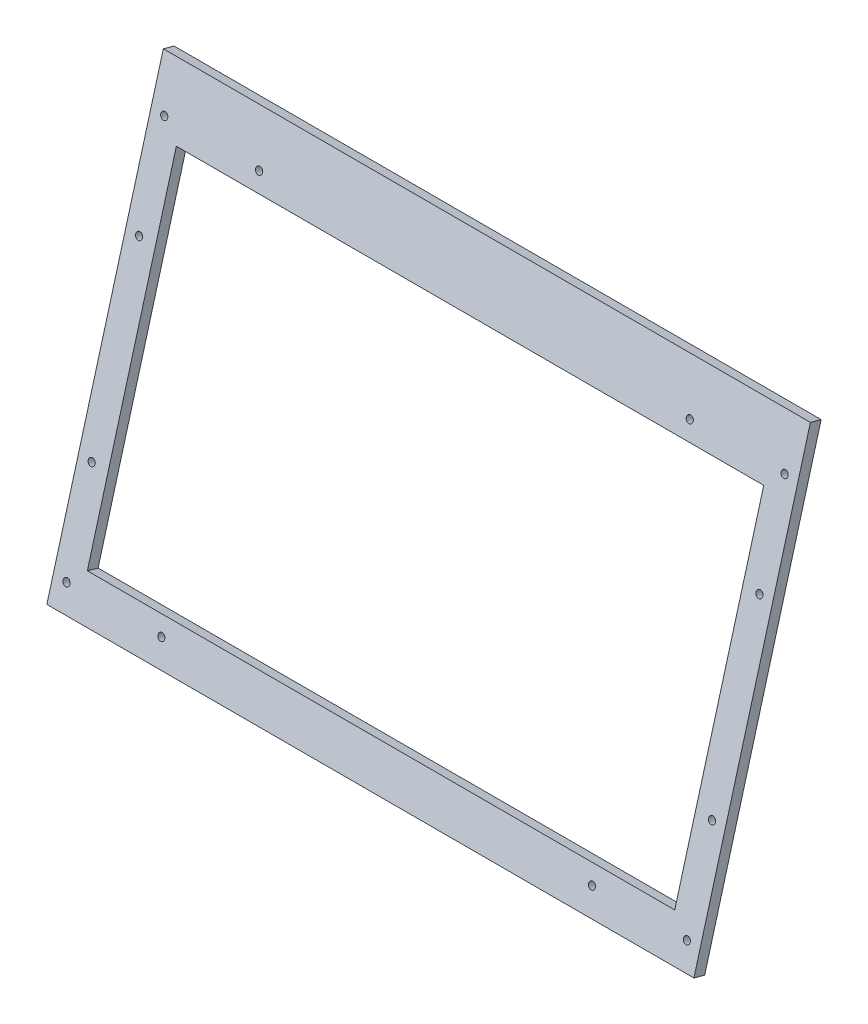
ISO-10303-21;
HEADER;
FILE_DESCRIPTION(('STEP AP214'),'2;1');
FILE_NAME('part.step','',(''),(''),'','','');
FILE_SCHEMA(('AUTOMOTIVE_DESIGN { 1 0 10303 214 1 1 1 1 }'));
ENDSEC;
DATA;
#1=APPLICATION_CONTEXT('core data for automotive mechanical design processes');
#2=APPLICATION_PROTOCOL_DEFINITION('international standard','automotive_design',2000,#1);
#3=PRODUCT_CONTEXT('',#1,'mechanical');
#4=PRODUCT('Part','Part','',(#3));
#5=PRODUCT_RELATED_PRODUCT_CATEGORY('part','',(#4));
#6=PRODUCT_DEFINITION_FORMATION('','',#4);
#7=PRODUCT_DEFINITION_CONTEXT('part definition',#1,'design');
#8=PRODUCT_DEFINITION('design','',#6,#7);
#9=PRODUCT_DEFINITION_SHAPE('','',#8);
#10=(LENGTH_UNIT() NAMED_UNIT(*) SI_UNIT(.MILLI.,.METRE.));
#11=(NAMED_UNIT(*) PLANE_ANGLE_UNIT() SI_UNIT($,.RADIAN.));
#12=(NAMED_UNIT(*) SI_UNIT($,.STERADIAN.) SOLID_ANGLE_UNIT());
#13=UNCERTAINTY_MEASURE_WITH_UNIT(LENGTH_MEASURE(1.E-05),#10,'distance_accuracy_value','');
#14=(GEOMETRIC_REPRESENTATION_CONTEXT(3) GLOBAL_UNCERTAINTY_ASSIGNED_CONTEXT((#13)) GLOBAL_UNIT_ASSIGNED_CONTEXT((#10,
#11,#12)) REPRESENTATION_CONTEXT('',''));
#15=CARTESIAN_POINT('',(0.,0.,0.));
#16=DIRECTION('',(0.,0.,1.));
#17=DIRECTION('',(1.,0.,0.));
#18=AXIS2_PLACEMENT_3D('',#15,#16,#17);
#19=CARTESIAN_POINT('',(600.,-3.42177176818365,-2.4853294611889));
#20=DIRECTION('',(0.,-0.964109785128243,0.265503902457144));
#21=DIRECTION('',(0.,-0.265503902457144,-0.964109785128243));
#22=AXIS2_PLACEMENT_3D('',#19,#20,#21);
#23=PLANE('',#22);
#24=DIRECTION('',(-1.,0.,0.));
#25=VECTOR('',#24,1.);
#26=CARTESIAN_POINT('',(600.,-6.07681079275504,-12.1264273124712));
#27=LINE('',#26,#25);
#28=CARTESIAN_POINT('',(590.,-6.07681079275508,-12.1264273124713));
#29=VERTEX_POINT('',#28);
#30=CARTESIAN_POINT('',(10.,-6.07681079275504,-12.1264273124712));
#31=VERTEX_POINT('',#30);
#32=EDGE_CURVE('E115',#29,#31,#27,.T.);
#33=ORIENTED_EDGE('',*,*,#32,.T.);
#34=DIRECTION('',(0.,0.265503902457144,0.964109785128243));
#35=VECTOR('',#34,1.);
#36=CARTESIAN_POINT('',(10.,-6.07681079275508,-12.1264273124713));
#37=LINE('',#36,#35);
#38=CARTESIAN_POINT('',(10.,-3.42177176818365,-2.4853294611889));
#39=VERTEX_POINT('',#38);
#40=EDGE_CURVE('E55',#31,#39,#37,.T.);
#41=ORIENTED_EDGE('',*,*,#40,.T.);
#42=DIRECTION('',(-1.,0.,0.));
#43=VECTOR('',#42,1.);
#44=CARTESIAN_POINT('',(600.,-3.42177176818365,-2.4853294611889));
#45=LINE('',#44,#43);
#46=CARTESIAN_POINT('',(590.,-3.42177176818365,-2.4853294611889));
#47=VERTEX_POINT('',#46);
#48=EDGE_CURVE('E117',#47,#39,#45,.T.);
#49=ORIENTED_EDGE('',*,*,#48,.F.);
#50=DIRECTION('',(0.,0.265503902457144,0.964109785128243));
#51=VECTOR('',#50,1.);
#52=CARTESIAN_POINT('',(590.,-6.07681079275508,-12.1264273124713));
#53=LINE('',#52,#51);
#54=EDGE_CURVE('E164',#29,#47,#53,.T.);
#55=ORIENTED_EDGE('',*,*,#54,.F.);
#56=EDGE_LOOP('',(#33,#41,#49,#55));
#57=FACE_BOUND('',#56,.T.);
#58=ADVANCED_FACE('F33',(#57),#23,.F.);
#59=CARTESIAN_POINT('',(600.,-382.51938037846,101.913460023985));
#60=DIRECTION('',(0.,-0.265503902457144,-0.964109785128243));
#61=DIRECTION('',(0.,0.964109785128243,-0.265503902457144));
#62=AXIS2_PLACEMENT_3D('',#59,#60,#61);
#63=PLANE('',#62);
#64=CARTESIAN_POINT('',(107.,-362.07061183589,96.2821222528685));
#65=DIRECTION('',(0.,-0.265503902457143,-0.964109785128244));
#66=DIRECTION('',(0.,0.964109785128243,-0.265503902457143));
#67=AXIS2_PLACEMENT_3D('',#64,#65,#66);
#68=CIRCLE('',#67,3.1);
#69=CARTESIAN_POINT('',(107.,-359.081871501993,95.4590601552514));
#70=VERTEX_POINT('',#69);
#71=EDGE_CURVE('E206',#70,#70,#68,.T.);
#72=ORIENTED_EDGE('',*,*,#71,.T.);
#73=EDGE_LOOP('',(#72));
#74=FACE_BOUND('',#73,.T.);
#75=CARTESIAN_POINT('',(493.,-362.07061183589,96.2821222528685));
#76=DIRECTION('',(0.,-0.265503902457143,-0.964109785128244));
#77=DIRECTION('',(0.,0.964109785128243,-0.265503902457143));
#78=AXIS2_PLACEMENT_3D('',#75,#76,#77);
#79=CIRCLE('',#78,3.09999999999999);
#80=CARTESIAN_POINT('',(493.,-359.081871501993,95.4590601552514));
#81=VERTEX_POINT('',#80);
#82=EDGE_CURVE('E213',#81,#81,#79,.T.);
#83=ORIENTED_EDGE('',*,*,#82,.T.);
#84=EDGE_LOOP('',(#83));
#85=FACE_BOUND('',#84,.T.);
#86=CARTESIAN_POINT('',(578.,-280.121280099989,73.7142905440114));
#87=DIRECTION('',(0.,-0.265503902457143,-0.964109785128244));
#88=DIRECTION('',(0.,0.964109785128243,-0.265503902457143));
#89=AXIS2_PLACEMENT_3D('',#86,#87,#88);
#90=CIRCLE('',#89,3.09999999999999);
#91=CARTESIAN_POINT('',(578.,-277.132539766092,72.8912284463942));
#92=VERTEX_POINT('',#91);
#93=EDGE_CURVE('E219',#92,#92,#90,.T.);
#94=ORIENTED_EDGE('',*,*,#93,.T.);
#95=EDGE_LOOP('',(#94));
#96=FACE_BOUND('',#95,.T.);
#97=CARTESIAN_POINT('',(493.,-43.9143827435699,8.66583444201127));
#98=DIRECTION('',(0.,-0.265503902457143,-0.964109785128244));
#99=DIRECTION('',(0.,0.964109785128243,-0.265503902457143));
#100=AXIS2_PLACEMENT_3D('',#97,#98,#99);
#101=CIRCLE('',#100,3.09999999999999);
#102=CARTESIAN_POINT('',(493.,-40.9256424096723,7.84277234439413));
#103=VERTEX_POINT('',#102);
#104=EDGE_CURVE('E183',#103,#103,#101,.T.);
#105=ORIENTED_EDGE('',*,*,#104,.T.);
#106=EDGE_LOOP('',(#105));
#107=FACE_BOUND('',#106,.T.);
#108=CARTESIAN_POINT('',(578.,-125.863714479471,31.2336661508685));
#109=DIRECTION('',(0.,-0.265503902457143,-0.964109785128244));
#110=DIRECTION('',(0.,0.964109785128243,-0.265503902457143));
#111=AXIS2_PLACEMENT_3D('',#108,#109,#110);
#112=CIRCLE('',#111,3.09999999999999);
#113=CARTESIAN_POINT('',(578.,-122.874974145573,30.4106040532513));
#114=VERTEX_POINT('',#113);
#115=EDGE_CURVE('E182',#114,#114,#112,.T.);
#116=ORIENTED_EDGE('',*,*,#115,.T.);
#117=EDGE_LOOP('',(#116));
#118=FACE_BOUND('',#117,.T.);
#119=CARTESIAN_POINT('',(22.,-43.9143827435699,8.66583444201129));
#120=DIRECTION('',(0.,-0.265503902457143,-0.964109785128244));
#121=DIRECTION('',(0.,0.964109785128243,-0.265503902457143));
#122=AXIS2_PLACEMENT_3D('',#119,#120,#121);
#123=CIRCLE('',#122,3.1);
#124=CARTESIAN_POINT('',(22.,-40.9256424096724,7.84277234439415));
#125=VERTEX_POINT('',#124);
#126=EDGE_CURVE('E189',#125,#125,#123,.T.);
#127=ORIENTED_EDGE('',*,*,#126,.T.);
#128=EDGE_LOOP('',(#127));
#129=FACE_BOUND('',#128,.T.);
#130=CARTESIAN_POINT('',(22.,-362.07061183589,96.2821222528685));
#131=DIRECTION('',(0.,-0.265503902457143,-0.964109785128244));
#132=DIRECTION('',(0.,0.964109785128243,-0.265503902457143));
#133=AXIS2_PLACEMENT_3D('',#130,#131,#132);
#134=CIRCLE('',#133,3.1);
#135=CARTESIAN_POINT('',(22.,-359.081871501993,95.4590601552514));
#136=VERTEX_POINT('',#135);
#137=EDGE_CURVE('E195',#136,#136,#134,.T.);
#138=ORIENTED_EDGE('',*,*,#137,.T.);
#139=EDGE_LOOP('',(#138));
#140=FACE_BOUND('',#139,.T.);
#141=CARTESIAN_POINT('',(578.,-362.07061183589,96.2821222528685));
#142=DIRECTION('',(0.,-0.265503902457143,-0.964109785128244));
#143=DIRECTION('',(0.,0.964109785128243,-0.265503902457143));
#144=AXIS2_PLACEMENT_3D('',#141,#142,#143);
#145=CIRCLE('',#144,3.09999999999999);
#146=CARTESIAN_POINT('',(578.,-359.081871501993,95.4590601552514));
#147=VERTEX_POINT('',#146);
#148=EDGE_CURVE('E176',#147,#147,#145,.T.);
#149=ORIENTED_EDGE('',*,*,#148,.T.);
#150=EDGE_LOOP('',(#149));
#151=FACE_BOUND('',#150,.T.);
#152=CARTESIAN_POINT('',(22.0000000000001,-280.121280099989,73.7142905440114));
#153=DIRECTION('',(0.,-0.265503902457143,-0.964109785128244));
#154=DIRECTION('',(0.,0.964109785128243,-0.265503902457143));
#155=AXIS2_PLACEMENT_3D('',#152,#153,#154);
#156=CIRCLE('',#155,3.09999999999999);
#157=CARTESIAN_POINT('',(22.0000000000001,-277.132539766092,72.8912284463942));
#158=VERTEX_POINT('',#157);
#159=EDGE_CURVE('E207',#158,#158,#156,.T.);
#160=ORIENTED_EDGE('',*,*,#159,.T.);
#161=EDGE_LOOP('',(#160));
#162=FACE_BOUND('',#161,.T.);
#163=CARTESIAN_POINT('',(22.,-125.863714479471,31.2336661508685));
#164=DIRECTION('',(0.,-0.265503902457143,-0.964109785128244));
#165=DIRECTION('',(0.,0.964109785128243,-0.265503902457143));
#166=AXIS2_PLACEMENT_3D('',#163,#164,#165);
#167=CIRCLE('',#166,3.1);
#168=CARTESIAN_POINT('',(22.,-122.874974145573,30.4106040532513));
#169=VERTEX_POINT('',#168);
#170=EDGE_CURVE('E236',#169,#169,#167,.T.);
#171=ORIENTED_EDGE('',*,*,#170,.T.);
#172=EDGE_LOOP('',(#171));
#173=FACE_BOUND('',#172,.T.);
#174=CARTESIAN_POINT('',(107.,-43.9143827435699,8.66583444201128));
#175=DIRECTION('',(0.,-0.265503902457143,-0.964109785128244));
#176=DIRECTION('',(0.,0.964109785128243,-0.265503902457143));
#177=AXIS2_PLACEMENT_3D('',#174,#175,#176);
#178=CIRCLE('',#177,3.1);
#179=CARTESIAN_POINT('',(107.,-40.9256424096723,7.84277234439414));
#180=VERTEX_POINT('',#179);
#181=EDGE_CURVE('E230',#180,#180,#178,.T.);
#182=ORIENTED_EDGE('',*,*,#181,.T.);
#183=EDGE_LOOP('',(#182));
#184=FACE_BOUND('',#183,.T.);
#185=CARTESIAN_POINT('',(578.,-43.9143827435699,8.66583444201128));
#186=DIRECTION('',(0.,-0.265503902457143,-0.964109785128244));
#187=DIRECTION('',(0.,0.964109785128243,-0.265503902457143));
#188=AXIS2_PLACEMENT_3D('',#185,#186,#187);
#189=CIRCLE('',#188,3.09999999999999);
#190=CARTESIAN_POINT('',(578.,-40.9256424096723,7.84277234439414));
#191=VERTEX_POINT('',#190);
#192=EDGE_CURVE('E169',#191,#191,#189,.T.);
#193=ORIENTED_EDGE('',*,*,#192,.T.);
#194=EDGE_LOOP('',(#193));
#195=FACE_BOUND('',#194,.T.);
#196=DIRECTION('',(1.,0.,0.));
#197=VECTOR('',#196,1.);
#198=CARTESIAN_POINT('',(36.7500000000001,-347.849992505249,92.3659396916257));
#199=LINE('',#198,#197);
#200=CARTESIAN_POINT('',(36.7500000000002,-347.849992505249,92.3659396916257));
#201=VERTEX_POINT('',#200);
#202=CARTESIAN_POINT('',(563.25,-347.849992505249,92.3659396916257));
#203=VERTEX_POINT('',#202);
#204=EDGE_CURVE('E158',#201,#203,#199,.T.);
#205=ORIENTED_EDGE('',*,*,#204,.F.);
#206=DIRECTION('',(0.,-0.964109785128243,0.265503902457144));
#207=VECTOR('',#206,1.);
#208=CARTESIAN_POINT('',(36.7500000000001,-58.1350020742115,12.582017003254));
#209=LINE('',#208,#207);
#210=CARTESIAN_POINT('',(36.7500000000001,-58.1350020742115,12.582017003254));
#211=VERTEX_POINT('',#210);
#212=EDGE_CURVE('E162',#211,#201,#209,.T.);
#213=ORIENTED_EDGE('',*,*,#212,.F.);
#214=DIRECTION('',(-1.,0.,0.));
#215=VECTOR('',#214,1.);
#216=CARTESIAN_POINT('',(36.7500000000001,-58.1350020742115,12.582017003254));
#217=LINE('',#216,#215);
#218=CARTESIAN_POINT('',(563.25,-58.1350020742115,12.582017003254));
#219=VERTEX_POINT('',#218);
#220=EDGE_CURVE('E152',#219,#211,#217,.T.);
#221=ORIENTED_EDGE('',*,*,#220,.F.);
#222=DIRECTION('',(0.,0.964109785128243,-0.265503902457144));
#223=VECTOR('',#222,1.);
#224=CARTESIAN_POINT('',(563.25,-58.1350020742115,12.582017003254));
#225=LINE('',#224,#223);
#226=EDGE_CURVE('E143',#203,#219,#225,.T.);
#227=ORIENTED_EDGE('',*,*,#226,.F.);
#228=EDGE_LOOP('',(#205,#213,#221,#227));
#229=FACE_BOUND('',#228,.T.);
#230=ORIENTED_EDGE('',*,*,#48,.T.);
#231=DIRECTION('',(0.,0.964109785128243,-0.265503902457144));
#232=VECTOR('',#231,1.);
#233=CARTESIAN_POINT('',(10.,-3.42177176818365,-2.4853294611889));
#234=LINE('',#233,#232);
#235=CARTESIAN_POINT('',(10.,-382.51938037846,101.913460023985));
#236=VERTEX_POINT('',#235);
#237=EDGE_CURVE('E103',#236,#39,#234,.T.);
#238=ORIENTED_EDGE('',*,*,#237,.F.);
#239=DIRECTION('',(-1.,0.,0.));
#240=VECTOR('',#239,1.);
#241=CARTESIAN_POINT('',(600.,-382.51938037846,101.913460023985));
#242=LINE('',#241,#240);
#243=CARTESIAN_POINT('',(590.,-382.51938037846,101.913460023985));
#244=VERTEX_POINT('',#243);
#245=EDGE_CURVE('E111',#244,#236,#242,.T.);
#246=ORIENTED_EDGE('',*,*,#245,.F.);
#247=DIRECTION('',(0.,-0.964109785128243,0.265503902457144));
#248=VECTOR('',#247,1.);
#249=CARTESIAN_POINT('',(590.,-3.42177176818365,-2.4853294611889));
#250=LINE('',#249,#248);
#251=EDGE_CURVE('E167',#47,#244,#250,.T.);
#252=ORIENTED_EDGE('',*,*,#251,.F.);
#253=EDGE_LOOP('',(#230,#238,#246,#252));
#254=FACE_BOUND('',#253,.T.);
#255=ADVANCED_FACE('F245',(#74,#85,#96,#107,#118,#129,#140,#151,#162,#173,#184,#195,#229,#254),
#63,.F.);
#256=CARTESIAN_POINT('',(600.,-385.174419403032,92.2723621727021));
#257=DIRECTION('',(0.,0.964109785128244,-0.265503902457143));
#258=DIRECTION('',(0.,0.265503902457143,0.964109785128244));
#259=AXIS2_PLACEMENT_3D('',#256,#257,#258);
#260=PLANE('',#259);
#261=ORIENTED_EDGE('',*,*,#245,.T.);
#262=DIRECTION('',(0.,0.265503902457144,0.964109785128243));
#263=VECTOR('',#262,1.);
#264=CARTESIAN_POINT('',(10.,-385.174419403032,92.2723621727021));
#265=LINE('',#264,#263);
#266=CARTESIAN_POINT('',(10.,-385.174419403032,92.2723621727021));
#267=VERTEX_POINT('',#266);
#268=EDGE_CURVE('E97',#267,#236,#265,.T.);
#269=ORIENTED_EDGE('',*,*,#268,.F.);
#270=DIRECTION('',(-1.,0.,0.));
#271=VECTOR('',#270,1.);
#272=CARTESIAN_POINT('',(600.,-385.174419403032,92.2723621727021));
#273=LINE('',#272,#271);
#274=CARTESIAN_POINT('',(590.,-385.174419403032,92.2723621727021));
#275=VERTEX_POINT('',#274);
#276=EDGE_CURVE('E109',#275,#267,#273,.T.);
#277=ORIENTED_EDGE('',*,*,#276,.F.);
#278=DIRECTION('',(0.,0.265503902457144,0.964109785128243));
#279=VECTOR('',#278,1.);
#280=CARTESIAN_POINT('',(590.,-385.174419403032,92.2723621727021));
#281=LINE('',#280,#279);
#282=EDGE_CURVE('E47',#275,#244,#281,.T.);
#283=ORIENTED_EDGE('',*,*,#282,.T.);
#284=EDGE_LOOP('',(#261,#269,#277,#283));
#285=FACE_BOUND('',#284,.T.);
#286=ADVANCED_FACE('F108',(#285),#260,.F.);
#287=CARTESIAN_POINT('',(600.,-6.07681079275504,-12.1264273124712));
#288=DIRECTION('',(0.,0.265503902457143,0.964109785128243));
#289=DIRECTION('',(0.,-0.964109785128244,0.265503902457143));
#290=AXIS2_PLACEMENT_3D('',#287,#288,#289);
#291=PLANE('',#290);
#292=CARTESIAN_POINT('',(107.,-364.725650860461,86.6410244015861));
#293=DIRECTION('',(0.,-0.265503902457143,-0.964109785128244));
#294=DIRECTION('',(0.,0.964109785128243,-0.265503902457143));
#295=AXIS2_PLACEMENT_3D('',#292,#293,#294);
#296=CIRCLE('',#295,3.1);
#297=CARTESIAN_POINT('',(107.,-361.736910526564,85.8179623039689));
#298=VERTEX_POINT('',#297);
#299=EDGE_CURVE('E203',#298,#298,#296,.T.);
#300=ORIENTED_EDGE('',*,*,#299,.F.);
#301=EDGE_LOOP('',(#300));
#302=FACE_BOUND('',#301,.T.);
#303=CARTESIAN_POINT('',(493.,-364.725650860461,86.6410244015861));
#304=DIRECTION('',(0.,-0.265503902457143,-0.964109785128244));
#305=DIRECTION('',(0.,0.964109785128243,-0.265503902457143));
#306=AXIS2_PLACEMENT_3D('',#303,#304,#305);
#307=CIRCLE('',#306,3.09999999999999);
#308=CARTESIAN_POINT('',(493.,-361.736910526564,85.817962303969));
#309=VERTEX_POINT('',#308);
#310=EDGE_CURVE('E210',#309,#309,#307,.T.);
#311=ORIENTED_EDGE('',*,*,#310,.F.);
#312=EDGE_LOOP('',(#311));
#313=FACE_BOUND('',#312,.T.);
#314=CARTESIAN_POINT('',(578.,-282.776319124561,64.0731926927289));
#315=DIRECTION('',(0.,-0.265503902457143,-0.964109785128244));
#316=DIRECTION('',(0.,0.964109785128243,-0.265503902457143));
#317=AXIS2_PLACEMENT_3D('',#314,#315,#316);
#318=CIRCLE('',#317,3.09999999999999);
#319=CARTESIAN_POINT('',(578.,-279.787578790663,63.2501305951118));
#320=VERTEX_POINT('',#319);
#321=EDGE_CURVE('E216',#320,#320,#318,.T.);
#322=ORIENTED_EDGE('',*,*,#321,.F.);
#323=EDGE_LOOP('',(#322));
#324=FACE_BOUND('',#323,.T.);
#325=CARTESIAN_POINT('',(493.,-46.5694217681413,-0.975263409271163));
#326=DIRECTION('',(0.,-0.265503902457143,-0.964109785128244));
#327=DIRECTION('',(0.,0.964109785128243,-0.265503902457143));
#328=AXIS2_PLACEMENT_3D('',#325,#326,#327);
#329=CIRCLE('',#328,3.09999999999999);
#330=CARTESIAN_POINT('',(493.,-43.5806814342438,-1.7983255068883));
#331=VERTEX_POINT('',#330);
#332=EDGE_CURVE('E222',#331,#331,#329,.T.);
#333=ORIENTED_EDGE('',*,*,#332,.F.);
#334=EDGE_LOOP('',(#333));
#335=FACE_BOUND('',#334,.T.);
#336=CARTESIAN_POINT('',(578.,-128.518753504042,21.592568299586));
#337=DIRECTION('',(0.,-0.265503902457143,-0.964109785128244));
#338=DIRECTION('',(0.,0.964109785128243,-0.265503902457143));
#339=AXIS2_PLACEMENT_3D('',#336,#337,#338);
#340=CIRCLE('',#339,3.09999999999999);
#341=CARTESIAN_POINT('',(578.,-125.530013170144,20.7695062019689));
#342=VERTEX_POINT('',#341);
#343=EDGE_CURVE('E179',#342,#342,#340,.T.);
#344=ORIENTED_EDGE('',*,*,#343,.F.);
#345=EDGE_LOOP('',(#344));
#346=FACE_BOUND('',#345,.T.);
#347=CARTESIAN_POINT('',(22.,-46.5694217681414,-0.975263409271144));
#348=DIRECTION('',(0.,-0.265503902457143,-0.964109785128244));
#349=DIRECTION('',(0.,0.964109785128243,-0.265503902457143));
#350=AXIS2_PLACEMENT_3D('',#347,#348,#349);
#351=CIRCLE('',#350,3.1);
#352=CARTESIAN_POINT('',(22.,-43.5806814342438,-1.79832550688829));
#353=VERTEX_POINT('',#352);
#354=EDGE_CURVE('E186',#353,#353,#351,.T.);
#355=ORIENTED_EDGE('',*,*,#354,.F.);
#356=EDGE_LOOP('',(#355));
#357=FACE_BOUND('',#356,.T.);
#358=CARTESIAN_POINT('',(22.,-364.725650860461,86.6410244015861));
#359=DIRECTION('',(0.,-0.265503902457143,-0.964109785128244));
#360=DIRECTION('',(0.,0.964109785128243,-0.265503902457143));
#361=AXIS2_PLACEMENT_3D('',#358,#359,#360);
#362=CIRCLE('',#361,3.1);
#363=CARTESIAN_POINT('',(22.,-361.736910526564,85.8179623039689));
#364=VERTEX_POINT('',#363);
#365=EDGE_CURVE('E192',#364,#364,#362,.T.);
#366=ORIENTED_EDGE('',*,*,#365,.F.);
#367=EDGE_LOOP('',(#366));
#368=FACE_BOUND('',#367,.T.);
#369=CARTESIAN_POINT('',(578.,-364.725650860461,86.6410244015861));
#370=DIRECTION('',(0.,-0.265503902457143,-0.964109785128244));
#371=DIRECTION('',(0.,0.964109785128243,-0.265503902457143));
#372=AXIS2_PLACEMENT_3D('',#369,#370,#371);
#373=CIRCLE('',#372,3.09999999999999);
#374=CARTESIAN_POINT('',(578.,-361.736910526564,85.817962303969));
#375=VERTEX_POINT('',#374);
#376=EDGE_CURVE('E198',#375,#375,#373,.T.);
#377=ORIENTED_EDGE('',*,*,#376,.F.);
#378=EDGE_LOOP('',(#377));
#379=FACE_BOUND('',#378,.T.);
#380=CARTESIAN_POINT('',(22.0000000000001,-282.776319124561,64.0731926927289));
#381=DIRECTION('',(0.,-0.265503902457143,-0.964109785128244));
#382=DIRECTION('',(0.,0.964109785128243,-0.265503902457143));
#383=AXIS2_PLACEMENT_3D('',#380,#381,#382);
#384=CIRCLE('',#383,3.09999999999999);
#385=CARTESIAN_POINT('',(22.0000000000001,-279.787578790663,63.2501305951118));
#386=VERTEX_POINT('',#385);
#387=EDGE_CURVE('E239',#386,#386,#384,.T.);
#388=ORIENTED_EDGE('',*,*,#387,.F.);
#389=EDGE_LOOP('',(#388));
#390=FACE_BOUND('',#389,.T.);
#391=CARTESIAN_POINT('',(22.,-128.518753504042,21.592568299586));
#392=DIRECTION('',(0.,-0.265503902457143,-0.964109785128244));
#393=DIRECTION('',(0.,0.964109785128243,-0.265503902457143));
#394=AXIS2_PLACEMENT_3D('',#391,#392,#393);
#395=CIRCLE('',#394,3.1);
#396=CARTESIAN_POINT('',(22.,-125.530013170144,20.7695062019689));
#397=VERTEX_POINT('',#396);
#398=EDGE_CURVE('E233',#397,#397,#395,.T.);
#399=ORIENTED_EDGE('',*,*,#398,.F.);
#400=EDGE_LOOP('',(#399));
#401=FACE_BOUND('',#400,.T.);
#402=CARTESIAN_POINT('',(107.,-46.5694217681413,-0.975263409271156));
#403=DIRECTION('',(0.,-0.265503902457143,-0.964109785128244));
#404=DIRECTION('',(0.,0.964109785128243,-0.265503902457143));
#405=AXIS2_PLACEMENT_3D('',#402,#403,#404);
#406=CIRCLE('',#405,3.1);
#407=CARTESIAN_POINT('',(107.,-43.5806814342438,-1.7983255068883));
#408=VERTEX_POINT('',#407);
#409=EDGE_CURVE('E227',#408,#408,#406,.T.);
#410=ORIENTED_EDGE('',*,*,#409,.F.);
#411=EDGE_LOOP('',(#410));
#412=FACE_BOUND('',#411,.T.);
#413=CARTESIAN_POINT('',(578.,-46.5694217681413,-0.975263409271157));
#414=DIRECTION('',(0.,-0.265503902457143,-0.964109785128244));
#415=DIRECTION('',(0.,0.964109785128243,-0.265503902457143));
#416=AXIS2_PLACEMENT_3D('',#413,#414,#415);
#417=CIRCLE('',#416,3.09999999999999);
#418=CARTESIAN_POINT('',(578.,-43.5806814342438,-1.7983255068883));
#419=VERTEX_POINT('',#418);
#420=EDGE_CURVE('E173',#419,#419,#417,.T.);
#421=ORIENTED_EDGE('',*,*,#420,.F.);
#422=EDGE_LOOP('',(#421));
#423=FACE_BOUND('',#422,.T.);
#424=DIRECTION('',(-1.,0.,0.));
#425=VECTOR('',#424,1.);
#426=CARTESIAN_POINT('',(600.,-60.7900410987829,2.9409191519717));
#427=LINE('',#426,#425);
#428=CARTESIAN_POINT('',(563.25,-60.7900410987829,2.94091915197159));
#429=VERTEX_POINT('',#428);
#430=CARTESIAN_POINT('',(36.7500000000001,-60.7900410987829,2.9409191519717));
#431=VERTEX_POINT('',#430);
#432=EDGE_CURVE('E40',#429,#431,#427,.T.);
#433=ORIENTED_EDGE('',*,*,#432,.T.);
#434=DIRECTION('',(0.,-0.964109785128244,0.265503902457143));
#435=VECTOR('',#434,1.);
#436=CARTESIAN_POINT('',(36.7500000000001,-6.07681079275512,-12.1264273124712));
#437=LINE('',#436,#435);
#438=CARTESIAN_POINT('',(36.7500000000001,-350.50503152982,82.7248418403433));
#439=VERTEX_POINT('',#438);
#440=EDGE_CURVE('E11',#431,#439,#437,.T.);
#441=ORIENTED_EDGE('',*,*,#440,.T.);
#442=DIRECTION('',(1.,0.,0.));
#443=VECTOR('',#442,1.);
#444=CARTESIAN_POINT('',(600.,-350.50503152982,82.7248418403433));
#445=LINE('',#444,#443);
#446=CARTESIAN_POINT('',(563.25,-350.50503152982,82.7248418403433));
#447=VERTEX_POINT('',#446);
#448=EDGE_CURVE('E125',#439,#447,#445,.T.);
#449=ORIENTED_EDGE('',*,*,#448,.T.);
#450=DIRECTION('',(0.,0.964109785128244,-0.265503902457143));
#451=VECTOR('',#450,1.);
#452=CARTESIAN_POINT('',(563.25,-6.07681079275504,-12.1264273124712));
#453=LINE('',#452,#451);
#454=EDGE_CURVE('E128',#447,#429,#453,.T.);
#455=ORIENTED_EDGE('',*,*,#454,.T.);
#456=EDGE_LOOP('',(#433,#441,#449,#455));
#457=FACE_BOUND('',#456,.T.);
#458=ORIENTED_EDGE('',*,*,#276,.T.);
#459=DIRECTION('',(0.,0.964109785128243,-0.265503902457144));
#460=VECTOR('',#459,1.);
#461=CARTESIAN_POINT('',(10.,-6.07681079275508,-12.1264273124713));
#462=LINE('',#461,#460);
#463=EDGE_CURVE('E94',#267,#31,#462,.T.);
#464=ORIENTED_EDGE('',*,*,#463,.T.);
#465=ORIENTED_EDGE('',*,*,#32,.F.);
#466=DIRECTION('',(0.,-0.964109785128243,0.265503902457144));
#467=VECTOR('',#466,1.);
#468=CARTESIAN_POINT('',(590.,-6.07681079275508,-12.1264273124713));
#469=LINE('',#468,#467);
#470=EDGE_CURVE('E114',#29,#275,#469,.T.);
#471=ORIENTED_EDGE('',*,*,#470,.T.);
#472=EDGE_LOOP('',(#458,#464,#465,#471));
#473=FACE_BOUND('',#472,.T.);
#474=ADVANCED_FACE('F113',(#302,#313,#324,#335,#346,#357,#368,#379,#390,#401,#412,#423,#457,
#473),#291,.F.);
#475=CARTESIAN_POINT('',(36.7500000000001,-190.886953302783,-469.472875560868));
#476=DIRECTION('',(-1.,0.,0.));
#477=DIRECTION('',(0.,-1.,0.));
#478=AXIS2_PLACEMENT_3D('',#475,#476,#477);
#479=PLANE('',#478);
#480=DIRECTION('',(0.,0.265503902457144,0.964109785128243));
#481=VECTOR('',#480,1.);
#482=CARTESIAN_POINT('',(36.7500000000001,-190.886953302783,-469.472875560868));
#483=LINE('',#482,#481);
#484=EDGE_CURVE('E119',#431,#211,#483,.T.);
#485=ORIENTED_EDGE('',*,*,#484,.T.);
#486=ORIENTED_EDGE('',*,*,#212,.T.);
#487=DIRECTION('',(0.,0.265503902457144,0.964109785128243));
#488=VECTOR('',#487,1.);
#489=CARTESIAN_POINT('',(36.7500000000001,-480.60194373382,-389.688952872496));
#490=LINE('',#489,#488);
#491=EDGE_CURVE('E148',#439,#201,#490,.T.);
#492=ORIENTED_EDGE('',*,*,#491,.F.);
#493=ORIENTED_EDGE('',*,*,#440,.F.);
#494=EDGE_LOOP('',(#485,#486,#492,#493));
#495=FACE_BOUND('',#494,.T.);
#496=ADVANCED_FACE('F258',(#495),#479,.F.);
#497=CARTESIAN_POINT('',(36.7500000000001,-190.886953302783,-469.472875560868));
#498=DIRECTION('',(0.,0.964109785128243,-0.265503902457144));
#499=DIRECTION('',(0.,0.265503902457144,0.964109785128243));
#500=AXIS2_PLACEMENT_3D('',#497,#498,#499);
#501=PLANE('',#500);
#502=DIRECTION('',(0.,0.265503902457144,0.964109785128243));
#503=VECTOR('',#502,1.);
#504=CARTESIAN_POINT('',(563.25,-190.886953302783,-469.472875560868));
#505=LINE('',#504,#503);
#506=EDGE_CURVE('E138',#429,#219,#505,.T.);
#507=ORIENTED_EDGE('',*,*,#506,.T.);
#508=ORIENTED_EDGE('',*,*,#220,.T.);
#509=ORIENTED_EDGE('',*,*,#484,.F.);
#510=ORIENTED_EDGE('',*,*,#432,.F.);
#511=EDGE_LOOP('',(#507,#508,#509,#510));
#512=FACE_BOUND('',#511,.T.);
#513=ADVANCED_FACE('F136',(#512),#501,.F.);
#514=CARTESIAN_POINT('',(563.25,-190.886953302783,-469.472875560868));
#515=DIRECTION('',(1.,0.,0.));
#516=DIRECTION('',(0.,0.,-1.));
#517=AXIS2_PLACEMENT_3D('',#514,#515,#516);
#518=PLANE('',#517);
#519=DIRECTION('',(0.,0.265503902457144,0.964109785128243));
#520=VECTOR('',#519,1.);
#521=CARTESIAN_POINT('',(563.25,-480.60194373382,-389.688952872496));
#522=LINE('',#521,#520);
#523=EDGE_CURVE('E145',#447,#203,#522,.T.);
#524=ORIENTED_EDGE('',*,*,#523,.T.);
#525=ORIENTED_EDGE('',*,*,#226,.T.);
#526=ORIENTED_EDGE('',*,*,#506,.F.);
#527=ORIENTED_EDGE('',*,*,#454,.F.);
#528=EDGE_LOOP('',(#524,#525,#526,#527));
#529=FACE_BOUND('',#528,.T.);
#530=ADVANCED_FACE('F141',(#529),#518,.F.);
#531=CARTESIAN_POINT('',(36.7500000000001,-480.60194373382,-389.688952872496));
#532=DIRECTION('',(0.,-0.964109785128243,0.265503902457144));
#533=DIRECTION('',(0.,-0.265503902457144,-0.964109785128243));
#534=AXIS2_PLACEMENT_3D('',#531,#532,#533);
#535=PLANE('',#534);
#536=ORIENTED_EDGE('',*,*,#491,.T.);
#537=ORIENTED_EDGE('',*,*,#204,.T.);
#538=ORIENTED_EDGE('',*,*,#523,.F.);
#539=ORIENTED_EDGE('',*,*,#448,.F.);
#540=EDGE_LOOP('',(#536,#537,#538,#539));
#541=FACE_BOUND('',#540,.T.);
#542=ADVANCED_FACE('F293',(#541),#535,.F.);
#543=CARTESIAN_POINT('',(590.,-6.07681079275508,-12.1264273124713));
#544=DIRECTION('',(-1.,0.,0.));
#545=DIRECTION('',(0.,0.,1.));
#546=AXIS2_PLACEMENT_3D('',#543,#544,#545);
#547=PLANE('',#546);
#548=ORIENTED_EDGE('',*,*,#251,.T.);
#549=ORIENTED_EDGE('',*,*,#282,.F.);
#550=ORIENTED_EDGE('',*,*,#470,.F.);
#551=ORIENTED_EDGE('',*,*,#54,.T.);
#552=EDGE_LOOP('',(#548,#549,#550,#551));
#553=FACE_BOUND('',#552,.T.);
#554=ADVANCED_FACE('F278',(#553),#547,.F.);
#555=CARTESIAN_POINT('',(10.,-6.07681079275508,-12.1264273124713));
#556=DIRECTION('',(1.,0.,0.));
#557=DIRECTION('',(0.,1.,0.));
#558=AXIS2_PLACEMENT_3D('',#555,#556,#557);
#559=PLANE('',#558);
#560=ORIENTED_EDGE('',*,*,#237,.T.);
#561=ORIENTED_EDGE('',*,*,#40,.F.);
#562=ORIENTED_EDGE('',*,*,#463,.F.);
#563=ORIENTED_EDGE('',*,*,#268,.T.);
#564=EDGE_LOOP('',(#560,#561,#562,#563));
#565=FACE_BOUND('',#564,.T.);
#566=ADVANCED_FACE('F96',(#565),#559,.F.);
#567=CARTESIAN_POINT('',(578.,-43.9143827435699,8.66583444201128));
#568=DIRECTION('',(0.,-0.265503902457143,-0.964109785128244));
#569=DIRECTION('',(0.,0.964109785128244,-0.265503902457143));
#570=AXIS2_PLACEMENT_3D('',#567,#568,#569);
#571=CYLINDRICAL_SURFACE('',#570,3.09999999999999);
#572=ORIENTED_EDGE('',*,*,#192,.F.);
#573=EDGE_LOOP('',(#572));
#574=FACE_BOUND('',#573,.T.);
#575=ORIENTED_EDGE('',*,*,#420,.T.);
#576=EDGE_LOOP('',(#575));
#577=FACE_BOUND('',#576,.T.);
#578=ADVANCED_FACE('F267',(#574,#577),#571,.F.);
#579=CARTESIAN_POINT('',(107.,-43.9143827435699,8.66583444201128));
#580=DIRECTION('',(0.,-0.265503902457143,-0.964109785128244));
#581=DIRECTION('',(0.,0.964109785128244,-0.265503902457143));
#582=AXIS2_PLACEMENT_3D('',#579,#580,#581);
#583=CYLINDRICAL_SURFACE('',#582,3.1);
#584=ORIENTED_EDGE('',*,*,#181,.F.);
#585=EDGE_LOOP('',(#584));
#586=FACE_BOUND('',#585,.T.);
#587=ORIENTED_EDGE('',*,*,#409,.T.);
#588=EDGE_LOOP('',(#587));
#589=FACE_BOUND('',#588,.T.);
#590=ADVANCED_FACE('F269',(#586,#589),#583,.F.);
#591=CARTESIAN_POINT('',(22.,-125.863714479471,31.2336661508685));
#592=DIRECTION('',(0.,-0.265503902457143,-0.964109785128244));
#593=DIRECTION('',(0.,0.964109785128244,-0.265503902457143));
#594=AXIS2_PLACEMENT_3D('',#591,#592,#593);
#595=CYLINDRICAL_SURFACE('',#594,3.1);
#596=ORIENTED_EDGE('',*,*,#170,.F.);
#597=EDGE_LOOP('',(#596));
#598=FACE_BOUND('',#597,.T.);
#599=ORIENTED_EDGE('',*,*,#398,.T.);
#600=EDGE_LOOP('',(#599));
#601=FACE_BOUND('',#600,.T.);
#602=ADVANCED_FACE('F252',(#598,#601),#595,.F.);
#603=CARTESIAN_POINT('',(22.0000000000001,-280.121280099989,73.7142905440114));
#604=DIRECTION('',(0.,-0.265503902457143,-0.964109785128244));
#605=DIRECTION('',(0.,0.964109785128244,-0.265503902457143));
#606=AXIS2_PLACEMENT_3D('',#603,#604,#605);
#607=CYLINDRICAL_SURFACE('',#606,3.09999999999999);
#608=ORIENTED_EDGE('',*,*,#159,.F.);
#609=EDGE_LOOP('',(#608));
#610=FACE_BOUND('',#609,.T.);
#611=ORIENTED_EDGE('',*,*,#387,.T.);
#612=EDGE_LOOP('',(#611));
#613=FACE_BOUND('',#612,.T.);
#614=ADVANCED_FACE('F248',(#610,#613),#607,.F.);
#615=CARTESIAN_POINT('',(578.,-362.07061183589,96.2821222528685));
#616=DIRECTION('',(0.,-0.265503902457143,-0.964109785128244));
#617=DIRECTION('',(0.,0.964109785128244,-0.265503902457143));
#618=AXIS2_PLACEMENT_3D('',#615,#616,#617);
#619=CYLINDRICAL_SURFACE('',#618,3.09999999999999);
#620=ORIENTED_EDGE('',*,*,#148,.F.);
#621=EDGE_LOOP('',(#620));
#622=FACE_BOUND('',#621,.T.);
#623=ORIENTED_EDGE('',*,*,#376,.T.);
#624=EDGE_LOOP('',(#623));
#625=FACE_BOUND('',#624,.T.);
#626=ADVANCED_FACE('F251',(#622,#625),#619,.F.);
#627=CARTESIAN_POINT('',(22.,-362.07061183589,96.2821222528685));
#628=DIRECTION('',(0.,-0.265503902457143,-0.964109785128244));
#629=DIRECTION('',(0.,0.964109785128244,-0.265503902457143));
#630=AXIS2_PLACEMENT_3D('',#627,#628,#629);
#631=CYLINDRICAL_SURFACE('',#630,3.1);
#632=ORIENTED_EDGE('',*,*,#137,.F.);
#633=EDGE_LOOP('',(#632));
#634=FACE_BOUND('',#633,.T.);
#635=ORIENTED_EDGE('',*,*,#365,.T.);
#636=EDGE_LOOP('',(#635));
#637=FACE_BOUND('',#636,.T.);
#638=ADVANCED_FACE('F392',(#634,#637),#631,.F.);
#639=CARTESIAN_POINT('',(22.,-43.9143827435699,8.66583444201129));
#640=DIRECTION('',(0.,-0.265503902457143,-0.964109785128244));
#641=DIRECTION('',(0.,0.964109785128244,-0.265503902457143));
#642=AXIS2_PLACEMENT_3D('',#639,#640,#641);
#643=CYLINDRICAL_SURFACE('',#642,3.1);
#644=ORIENTED_EDGE('',*,*,#126,.F.);
#645=EDGE_LOOP('',(#644));
#646=FACE_BOUND('',#645,.T.);
#647=ORIENTED_EDGE('',*,*,#354,.T.);
#648=EDGE_LOOP('',(#647));
#649=FACE_BOUND('',#648,.T.);
#650=ADVANCED_FACE('F401',(#646,#649),#643,.F.);
#651=CARTESIAN_POINT('',(578.,-125.863714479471,31.2336661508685));
#652=DIRECTION('',(0.,-0.265503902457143,-0.964109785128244));
#653=DIRECTION('',(0.,0.964109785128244,-0.265503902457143));
#654=AXIS2_PLACEMENT_3D('',#651,#652,#653);
#655=CYLINDRICAL_SURFACE('',#654,3.09999999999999);
#656=ORIENTED_EDGE('',*,*,#115,.F.);
#657=EDGE_LOOP('',(#656));
#658=FACE_BOUND('',#657,.T.);
#659=ORIENTED_EDGE('',*,*,#343,.T.);
#660=EDGE_LOOP('',(#659));
#661=FACE_BOUND('',#660,.T.);
#662=ADVANCED_FACE('F410',(#658,#661),#655,.F.);
#663=CARTESIAN_POINT('',(493.,-43.9143827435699,8.66583444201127));
#664=DIRECTION('',(0.,-0.265503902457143,-0.964109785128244));
#665=DIRECTION('',(0.,0.964109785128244,-0.265503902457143));
#666=AXIS2_PLACEMENT_3D('',#663,#664,#665);
#667=CYLINDRICAL_SURFACE('',#666,3.09999999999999);
#668=ORIENTED_EDGE('',*,*,#104,.F.);
#669=EDGE_LOOP('',(#668));
#670=FACE_BOUND('',#669,.T.);
#671=ORIENTED_EDGE('',*,*,#332,.T.);
#672=EDGE_LOOP('',(#671));
#673=FACE_BOUND('',#672,.T.);
#674=ADVANCED_FACE('F419',(#670,#673),#667,.F.);
#675=CARTESIAN_POINT('',(578.,-280.121280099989,73.7142905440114));
#676=DIRECTION('',(0.,-0.265503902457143,-0.964109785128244));
#677=DIRECTION('',(0.,0.964109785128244,-0.265503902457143));
#678=AXIS2_PLACEMENT_3D('',#675,#676,#677);
#679=CYLINDRICAL_SURFACE('',#678,3.09999999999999);
#680=ORIENTED_EDGE('',*,*,#93,.F.);
#681=EDGE_LOOP('',(#680));
#682=FACE_BOUND('',#681,.T.);
#683=ORIENTED_EDGE('',*,*,#321,.T.);
#684=EDGE_LOOP('',(#683));
#685=FACE_BOUND('',#684,.T.);
#686=ADVANCED_FACE('F427',(#682,#685),#679,.F.);
#687=CARTESIAN_POINT('',(493.,-362.07061183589,96.2821222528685));
#688=DIRECTION('',(0.,-0.265503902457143,-0.964109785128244));
#689=DIRECTION('',(0.,0.964109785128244,-0.265503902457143));
#690=AXIS2_PLACEMENT_3D('',#687,#688,#689);
#691=CYLINDRICAL_SURFACE('',#690,3.09999999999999);
#692=ORIENTED_EDGE('',*,*,#82,.F.);
#693=EDGE_LOOP('',(#692));
#694=FACE_BOUND('',#693,.T.);
#695=ORIENTED_EDGE('',*,*,#310,.T.);
#696=EDGE_LOOP('',(#695));
#697=FACE_BOUND('',#696,.T.);
#698=ADVANCED_FACE('F436',(#694,#697),#691,.F.);
#699=CARTESIAN_POINT('',(107.,-362.07061183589,96.2821222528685));
#700=DIRECTION('',(0.,-0.265503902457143,-0.964109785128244));
#701=DIRECTION('',(0.,0.964109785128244,-0.265503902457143));
#702=AXIS2_PLACEMENT_3D('',#699,#700,#701);
#703=CYLINDRICAL_SURFACE('',#702,3.1);
#704=ORIENTED_EDGE('',*,*,#71,.F.);
#705=EDGE_LOOP('',(#704));
#706=FACE_BOUND('',#705,.T.);
#707=ORIENTED_EDGE('',*,*,#299,.T.);
#708=EDGE_LOOP('',(#707));
#709=FACE_BOUND('',#708,.T.);
#710=ADVANCED_FACE('F445',(#706,#709),#703,.F.);
#711=CLOSED_SHELL('',(#58,#255,#286,#474,#496,#513,#530,#542,#554,#566,#578,#590,#602,#614,#626,
#638,#650,#662,#674,#686,#698,#710));
#712=MANIFOLD_SOLID_BREP('B2',#711);
#713=ADVANCED_BREP_SHAPE_REPRESENTATION('',(#18,#712),#14);
#714=SHAPE_DEFINITION_REPRESENTATION(#9,#713);
ENDSEC;
END-ISO-10303-21;
